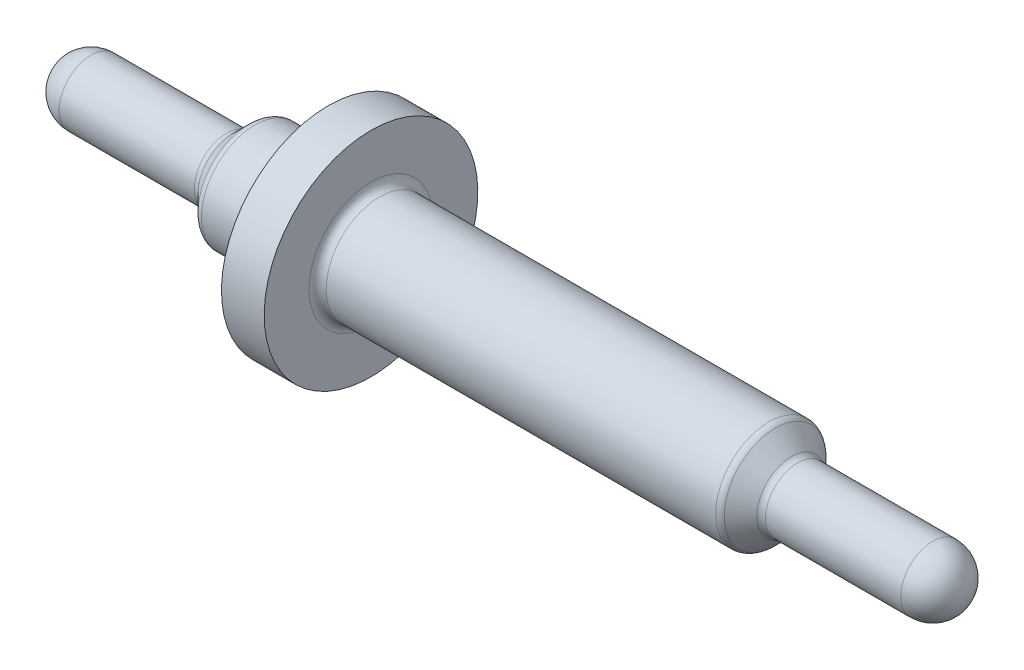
ISO-10303-21;
HEADER;
FILE_DESCRIPTION(('STEP AP214'),'2;1');
FILE_NAME('part.step','',(''),(''),'','','');
FILE_SCHEMA(('AUTOMOTIVE_DESIGN { 1 0 10303 214 1 1 1 1 }'));
ENDSEC;
DATA;
#1=APPLICATION_CONTEXT('core data for automotive mechanical design processes');
#2=APPLICATION_PROTOCOL_DEFINITION('international standard','automotive_design',2000,#1);
#3=PRODUCT_CONTEXT('',#1,'mechanical');
#4=PRODUCT('Part','Part','',(#3));
#5=PRODUCT_RELATED_PRODUCT_CATEGORY('part','',(#4));
#6=PRODUCT_DEFINITION_FORMATION('','',#4);
#7=PRODUCT_DEFINITION_CONTEXT('part definition',#1,'design');
#8=PRODUCT_DEFINITION('design','',#6,#7);
#9=PRODUCT_DEFINITION_SHAPE('','',#8);
#10=(LENGTH_UNIT() NAMED_UNIT(*) SI_UNIT(.MILLI.,.METRE.));
#11=(NAMED_UNIT(*) PLANE_ANGLE_UNIT() SI_UNIT($,.RADIAN.));
#12=(NAMED_UNIT(*) SI_UNIT($,.STERADIAN.) SOLID_ANGLE_UNIT());
#13=UNCERTAINTY_MEASURE_WITH_UNIT(LENGTH_MEASURE(1.E-05),#10,'distance_accuracy_value','');
#14=(GEOMETRIC_REPRESENTATION_CONTEXT(3) GLOBAL_UNCERTAINTY_ASSIGNED_CONTEXT((#13)) GLOBAL_UNIT_ASSIGNED_CONTEXT((#10,
#11,#12)) REPRESENTATION_CONTEXT('',''));
#15=CARTESIAN_POINT('',(0.,0.,0.));
#16=DIRECTION('',(0.,0.,1.));
#17=DIRECTION('',(1.,0.,0.));
#18=AXIS2_PLACEMENT_3D('',#15,#16,#17);
#19=CARTESIAN_POINT('',(21.2,0.,0.));
#20=DIRECTION('',(1.,0.,0.));
#21=DIRECTION('',(0.,1.,0.));
#22=AXIS2_PLACEMENT_3D('',#19,#20,#21);
#23=CYLINDRICAL_SURFACE('',#22,0.749999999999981);
#24=CARTESIAN_POINT('',(3.91715728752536,0.,0.));
#25=DIRECTION('',(1.,0.,0.));
#26=DIRECTION('',(0.,1.,0.));
#27=AXIS2_PLACEMENT_3D('',#24,#25,#26);
#28=CIRCLE('',#27,0.749999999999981);
#29=CARTESIAN_POINT('',(3.91715728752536,0.749999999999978,0.));
#30=VERTEX_POINT('',#29);
#31=EDGE_CURVE('E29',#30,#30,#28,.F.);
#32=ORIENTED_EDGE('',*,*,#31,.T.);
#33=EDGE_LOOP('',(#32));
#34=FACE_BOUND('',#33,.T.);
#35=CARTESIAN_POINT('',(0.75,0.,0.));
#36=DIRECTION('',(1.,0.,0.));
#37=DIRECTION('',(0.,1.,0.));
#38=AXIS2_PLACEMENT_3D('',#35,#36,#37);
#39=CIRCLE('',#38,0.749999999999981);
#40=CARTESIAN_POINT('',(0.750000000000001,0.74999999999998,0.));
#41=VERTEX_POINT('',#40);
#42=EDGE_CURVE('E58',#41,#41,#39,.T.);
#43=ORIENTED_EDGE('',*,*,#42,.T.);
#44=EDGE_LOOP('',(#43));
#45=FACE_BOUND('',#44,.T.);
#46=ADVANCED_FACE('F14',(#34,#45),#23,.T.);
#47=CARTESIAN_POINT('',(21.2,0.,0.));
#48=DIRECTION('',(1.,0.,0.));
#49=DIRECTION('',(0.,1.,0.));
#50=AXIS2_PLACEMENT_3D('',#47,#48,#49);
#51=CYLINDRICAL_SURFACE('',#50,1.25);
#52=CARTESIAN_POINT('',(6.1,0.,0.));
#53=DIRECTION('',(-1.,0.,0.));
#54=DIRECTION('',(0.,-1.,0.));
#55=AXIS2_PLACEMENT_3D('',#52,#53,#54);
#56=CIRCLE('',#55,1.25);
#57=CARTESIAN_POINT('',(6.1,-1.25,0.));
#58=VERTEX_POINT('',#57);
#59=EDGE_CURVE('E49',#58,#58,#56,.T.);
#60=ORIENTED_EDGE('',*,*,#59,.T.);
#61=EDGE_LOOP('',(#60));
#62=FACE_BOUND('',#61,.T.);
#63=CARTESIAN_POINT('',(4.58284271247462,0.,0.));
#64=DIRECTION('',(-1.,0.,0.));
#65=DIRECTION('',(0.,-1.,0.));
#66=AXIS2_PLACEMENT_3D('',#63,#64,#65);
#67=CIRCLE('',#66,1.25);
#68=CARTESIAN_POINT('',(4.58284271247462,-1.25,0.));
#69=VERTEX_POINT('',#68);
#70=EDGE_CURVE('E52',#69,#69,#67,.F.);
#71=ORIENTED_EDGE('',*,*,#70,.T.);
#72=EDGE_LOOP('',(#71));
#73=FACE_BOUND('',#72,.T.);
#74=ADVANCED_FACE('F87',(#62,#73),#51,.T.);
#75=CARTESIAN_POINT('',(6.3,1.25,0.));
#76=DIRECTION('',(-1.,0.,0.));
#77=DIRECTION('',(0.,-1.,0.));
#78=AXIS2_PLACEMENT_3D('',#75,#76,#77);
#79=PLANE('',#78);
#80=CARTESIAN_POINT('',(6.3,0.,0.));
#81=DIRECTION('',(-1.,0.,0.));
#82=DIRECTION('',(0.,-1.,0.));
#83=AXIS2_PLACEMENT_3D('',#80,#81,#82);
#84=CIRCLE('',#83,1.45);
#85=CARTESIAN_POINT('',(6.3,-1.45,0.));
#86=VERTEX_POINT('',#85);
#87=EDGE_CURVE('E55',#86,#86,#84,.F.);
#88=ORIENTED_EDGE('',*,*,#87,.T.);
#89=EDGE_LOOP('',(#88));
#90=FACE_BOUND('',#89,.T.);
#91=CARTESIAN_POINT('',(6.3,0.,0.));
#92=DIRECTION('',(1.,0.,0.));
#93=DIRECTION('',(0.,1.,0.));
#94=AXIS2_PLACEMENT_3D('',#91,#92,#93);
#95=CIRCLE('',#94,2.5);
#96=CARTESIAN_POINT('',(6.3,2.5,0.));
#97=VERTEX_POINT('',#96);
#98=EDGE_CURVE('E64',#97,#97,#95,.T.);
#99=ORIENTED_EDGE('',*,*,#98,.F.);
#100=EDGE_LOOP('',(#99));
#101=FACE_BOUND('',#100,.T.);
#102=ADVANCED_FACE('F75',(#90,#101),#79,.T.);
#103=CARTESIAN_POINT('',(21.2,0.,0.));
#104=DIRECTION('',(1.,0.,0.));
#105=DIRECTION('',(0.,1.,0.));
#106=AXIS2_PLACEMENT_3D('',#103,#104,#105);
#107=CYLINDRICAL_SURFACE('',#106,2.5);
#108=ORIENTED_EDGE('',*,*,#98,.T.);
#109=EDGE_LOOP('',(#108));
#110=FACE_BOUND('',#109,.T.);
#111=CARTESIAN_POINT('',(7.3,0.,0.));
#112=DIRECTION('',(1.,0.,0.));
#113=DIRECTION('',(0.,1.,0.));
#114=AXIS2_PLACEMENT_3D('',#111,#112,#113);
#115=CIRCLE('',#114,2.5);
#116=CARTESIAN_POINT('',(7.3,2.49999999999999,0.));
#117=VERTEX_POINT('',#116);
#118=EDGE_CURVE('E67',#117,#117,#115,.T.);
#119=ORIENTED_EDGE('',*,*,#118,.F.);
#120=EDGE_LOOP('',(#119));
#121=FACE_BOUND('',#120,.T.);
#122=ADVANCED_FACE('F73',(#110,#121),#107,.T.);
#123=CARTESIAN_POINT('',(7.3,2.5,0.));
#124=DIRECTION('',(1.,0.,0.));
#125=DIRECTION('',(0.,1.,0.));
#126=AXIS2_PLACEMENT_3D('',#123,#124,#125);
#127=PLANE('',#126);
#128=CARTESIAN_POINT('',(7.3,0.,0.));
#129=DIRECTION('',(1.,0.,0.));
#130=DIRECTION('',(0.,1.,0.));
#131=AXIS2_PLACEMENT_3D('',#128,#129,#130);
#132=CIRCLE('',#131,1.45);
#133=CARTESIAN_POINT('',(7.3,1.44999999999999,0.));
#134=VERTEX_POINT('',#133);
#135=EDGE_CURVE('E40',#134,#134,#132,.F.);
#136=ORIENTED_EDGE('',*,*,#135,.T.);
#137=EDGE_LOOP('',(#136));
#138=FACE_BOUND('',#137,.T.);
#139=ORIENTED_EDGE('',*,*,#118,.T.);
#140=EDGE_LOOP('',(#139));
#141=FACE_BOUND('',#140,.T.);
#142=ADVANCED_FACE('F71',(#138,#141),#127,.T.);
#143=CARTESIAN_POINT('',(21.2,0.,0.));
#144=DIRECTION('',(1.,0.,0.));
#145=DIRECTION('',(0.,1.,0.));
#146=AXIS2_PLACEMENT_3D('',#143,#144,#145);
#147=CYLINDRICAL_SURFACE('',#146,1.25);
#148=CARTESIAN_POINT('',(7.5,0.,0.));
#149=DIRECTION('',(1.,0.,0.));
#150=DIRECTION('',(0.,1.,0.));
#151=AXIS2_PLACEMENT_3D('',#148,#149,#150);
#152=CIRCLE('',#151,1.25);
#153=CARTESIAN_POINT('',(7.5,1.24999999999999,0.));
#154=VERTEX_POINT('',#153);
#155=EDGE_CURVE('E43',#154,#154,#152,.T.);
#156=ORIENTED_EDGE('',*,*,#155,.T.);
#157=EDGE_LOOP('',(#156));
#158=FACE_BOUND('',#157,.T.);
#159=CARTESIAN_POINT('',(16.6171572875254,0.,0.));
#160=DIRECTION('',(1.,0.,0.));
#161=DIRECTION('',(0.,1.,0.));
#162=AXIS2_PLACEMENT_3D('',#159,#160,#161);
#163=CIRCLE('',#162,1.25);
#164=CARTESIAN_POINT('',(16.6171572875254,1.24999999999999,0.));
#165=VERTEX_POINT('',#164);
#166=EDGE_CURVE('E46',#165,#165,#163,.F.);
#167=ORIENTED_EDGE('',*,*,#166,.T.);
#168=EDGE_LOOP('',(#167));
#169=FACE_BOUND('',#168,.T.);
#170=ADVANCED_FACE('F84',(#158,#169),#147,.T.);
#171=CARTESIAN_POINT('',(21.2,0.,0.));
#172=DIRECTION('',(1.,0.,0.));
#173=DIRECTION('',(0.,1.,0.));
#174=AXIS2_PLACEMENT_3D('',#171,#172,#173);
#175=CYLINDRICAL_SURFACE('',#174,0.750000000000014);
#176=CARTESIAN_POINT('',(17.2828427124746,0.,0.));
#177=DIRECTION('',(1.,0.,0.));
#178=DIRECTION('',(0.,1.,0.));
#179=AXIS2_PLACEMENT_3D('',#176,#177,#178);
#180=CIRCLE('',#179,0.750000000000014);
#181=CARTESIAN_POINT('',(17.2828427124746,0.750000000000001,0.));
#182=VERTEX_POINT('',#181);
#183=EDGE_CURVE('E25',#182,#182,#180,.T.);
#184=ORIENTED_EDGE('',*,*,#183,.T.);
#185=EDGE_LOOP('',(#184));
#186=FACE_BOUND('',#185,.T.);
#187=CARTESIAN_POINT('',(20.45,0.,0.));
#188=DIRECTION('',(1.,0.,0.));
#189=DIRECTION('',(0.,1.,0.));
#190=AXIS2_PLACEMENT_3D('',#187,#188,#189);
#191=CIRCLE('',#190,0.750000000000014);
#192=CARTESIAN_POINT('',(20.45,0.749999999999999,0.));
#193=VERTEX_POINT('',#192);
#194=EDGE_CURVE('E61',#193,#193,#191,.F.);
#195=ORIENTED_EDGE('',*,*,#194,.T.);
#196=EDGE_LOOP('',(#195));
#197=FACE_BOUND('',#196,.T.);
#198=ADVANCED_FACE('F105',(#186,#197),#175,.T.);
#199=CARTESIAN_POINT('',(20.45,0.,0.));
#200=DIRECTION('',(0.,0.,1.));
#201=DIRECTION('',(1.,0.,0.));
#202=AXIS2_PLACEMENT_3D('',#199,#200,#201);
#203=SPHERICAL_SURFACE('',#202,0.75);
#204=CARTESIAN_POINT('',(20.45,0.,0.));
#205=DIRECTION('',(1.,0.,0.));
#206=DIRECTION('',(0.,1.,0.));
#207=AXIS2_PLACEMENT_3D('',#204,#205,#206);
#208=SPHERICAL_SURFACE('',#207,0.75);
#209=ORIENTED_EDGE('',*,*,#194,.F.);
#210=EDGE_LOOP('',(#209));
#211=FACE_BOUND('',#210,.T.);
#212=ADVANCED_FACE('F101',(#211),#208,.T.);
#213=CARTESIAN_POINT('',(0.75,0.,0.));
#214=DIRECTION('',(0.,0.,1.));
#215=DIRECTION('',(1.,0.,0.));
#216=AXIS2_PLACEMENT_3D('',#213,#214,#215);
#217=SPHERICAL_SURFACE('',#216,0.75);
#218=CARTESIAN_POINT('',(0.75,0.,0.));
#219=DIRECTION('',(1.,0.,0.));
#220=DIRECTION('',(0.,1.,0.));
#221=AXIS2_PLACEMENT_3D('',#218,#219,#220);
#222=SPHERICAL_SURFACE('',#221,0.75);
#223=ORIENTED_EDGE('',*,*,#42,.F.);
#224=EDGE_LOOP('',(#223));
#225=FACE_BOUND('',#224,.T.);
#226=ADVANCED_FACE('F104',(#225),#222,.T.);
#227=CARTESIAN_POINT('',(4.5,0.,0.));
#228=DIRECTION('',(1.,0.,0.));
#229=DIRECTION('',(0.,1.,0.));
#230=AXIS2_PLACEMENT_3D('',#227,#228,#229);
#231=CONICAL_SURFACE('',#230,1.25,0.785398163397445);
#232=CARTESIAN_POINT('',(4.44142135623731,0.,0.));
#233=DIRECTION('',(-1.,0.,0.));
#234=DIRECTION('',(0.,-1.,0.));
#235=AXIS2_PLACEMENT_3D('',#232,#233,#234);
#236=CIRCLE('',#235,1.19142135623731);
#237=CARTESIAN_POINT('',(4.44142135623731,-1.19142135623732,0.));
#238=VERTEX_POINT('',#237);
#239=EDGE_CURVE('E34',#238,#238,#236,.T.);
#240=ORIENTED_EDGE('',*,*,#239,.T.);
#241=EDGE_LOOP('',(#240));
#242=FACE_BOUND('',#241,.T.);
#243=CARTESIAN_POINT('',(4.05857864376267,0.,0.));
#244=DIRECTION('',(1.,0.,0.));
#245=DIRECTION('',(0.,1.,0.));
#246=AXIS2_PLACEMENT_3D('',#243,#244,#245);
#247=CIRCLE('',#246,0.808578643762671);
#248=CARTESIAN_POINT('',(4.05857864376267,0.808578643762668,0.));
#249=VERTEX_POINT('',#248);
#250=EDGE_CURVE('E37',#249,#249,#247,.T.);
#251=ORIENTED_EDGE('',*,*,#250,.T.);
#252=EDGE_LOOP('',(#251));
#253=FACE_BOUND('',#252,.T.);
#254=ADVANCED_FACE('F109',(#242,#253),#231,.T.);
#255=CARTESIAN_POINT('',(17.2,0.,0.));
#256=DIRECTION('',(-1.,0.,0.));
#257=DIRECTION('',(0.,-1.,0.));
#258=AXIS2_PLACEMENT_3D('',#255,#256,#257);
#259=CONICAL_SURFACE('',#258,0.75,0.78539816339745);
#260=CARTESIAN_POINT('',(17.1414213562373,0.,0.));
#261=DIRECTION('',(-1.,0.,0.));
#262=DIRECTION('',(0.,-1.,0.));
#263=AXIS2_PLACEMENT_3D('',#260,#261,#262);
#264=CIRCLE('',#263,0.808578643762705);
#265=CARTESIAN_POINT('',(17.1414213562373,-0.808578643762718,0.));
#266=VERTEX_POINT('',#265);
#267=EDGE_CURVE('E10',#266,#266,#264,.T.);
#268=ORIENTED_EDGE('',*,*,#267,.T.);
#269=EDGE_LOOP('',(#268));
#270=FACE_BOUND('',#269,.T.);
#271=CARTESIAN_POINT('',(16.7585786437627,0.,0.));
#272=DIRECTION('',(1.,0.,0.));
#273=DIRECTION('',(0.,1.,0.));
#274=AXIS2_PLACEMENT_3D('',#271,#272,#273);
#275=CIRCLE('',#274,1.1914213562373);
#276=CARTESIAN_POINT('',(16.7585786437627,1.19142135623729,0.));
#277=VERTEX_POINT('',#276);
#278=EDGE_CURVE('E21',#277,#277,#275,.T.);
#279=ORIENTED_EDGE('',*,*,#278,.T.);
#280=EDGE_LOOP('',(#279));
#281=FACE_BOUND('',#280,.T.);
#282=ADVANCED_FACE('F113',(#270,#281),#259,.T.);
#283=CARTESIAN_POINT('',(6.1,0.,0.));
#284=DIRECTION('',(-1.,0.,0.));
#285=DIRECTION('',(0.,-1.,0.));
#286=AXIS2_PLACEMENT_3D('',#283,#284,#285);
#287=TOROIDAL_SURFACE('',#286,1.45,0.2);
#288=ORIENTED_EDGE('',*,*,#59,.F.);
#289=EDGE_LOOP('',(#288));
#290=FACE_BOUND('',#289,.T.);
#291=ORIENTED_EDGE('',*,*,#87,.F.);
#292=EDGE_LOOP('',(#291));
#293=FACE_BOUND('',#292,.T.);
#294=ADVANCED_FACE('F117',(#290,#293),#287,.F.);
#295=CARTESIAN_POINT('',(7.5,0.,0.));
#296=DIRECTION('',(1.,0.,0.));
#297=DIRECTION('',(0.,1.,0.));
#298=AXIS2_PLACEMENT_3D('',#295,#296,#297);
#299=TOROIDAL_SURFACE('',#298,1.45,0.2);
#300=ORIENTED_EDGE('',*,*,#135,.F.);
#301=EDGE_LOOP('',(#300));
#302=FACE_BOUND('',#301,.T.);
#303=ORIENTED_EDGE('',*,*,#155,.F.);
#304=EDGE_LOOP('',(#303));
#305=FACE_BOUND('',#304,.T.);
#306=ADVANCED_FACE('F120',(#302,#305),#299,.F.);
#307=CARTESIAN_POINT('',(4.58284271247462,0.,0.));
#308=DIRECTION('',(-1.,0.,0.));
#309=DIRECTION('',(0.,-1.,0.));
#310=AXIS2_PLACEMENT_3D('',#307,#308,#309);
#311=TOROIDAL_SURFACE('',#310,1.05,0.2);
#312=ORIENTED_EDGE('',*,*,#239,.F.);
#313=EDGE_LOOP('',(#312));
#314=FACE_BOUND('',#313,.T.);
#315=ORIENTED_EDGE('',*,*,#70,.F.);
#316=EDGE_LOOP('',(#315));
#317=FACE_BOUND('',#316,.T.);
#318=ADVANCED_FACE('F124',(#314,#317),#311,.T.);
#319=CARTESIAN_POINT('',(3.91715728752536,0.,0.));
#320=DIRECTION('',(1.,0.,0.));
#321=DIRECTION('',(0.,1.,0.));
#322=AXIS2_PLACEMENT_3D('',#319,#320,#321);
#323=TOROIDAL_SURFACE('',#322,0.949999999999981,0.2);
#324=ORIENTED_EDGE('',*,*,#31,.F.);
#325=EDGE_LOOP('',(#324));
#326=FACE_BOUND('',#325,.T.);
#327=ORIENTED_EDGE('',*,*,#250,.F.);
#328=EDGE_LOOP('',(#327));
#329=FACE_BOUND('',#328,.T.);
#330=ADVANCED_FACE('F128',(#326,#329),#323,.F.);
#331=CARTESIAN_POINT('',(17.2828427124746,0.,0.));
#332=DIRECTION('',(1.,0.,0.));
#333=DIRECTION('',(0.,1.,0.));
#334=AXIS2_PLACEMENT_3D('',#331,#332,#333);
#335=TOROIDAL_SURFACE('',#334,0.950000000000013,0.2);
#336=ORIENTED_EDGE('',*,*,#267,.F.);
#337=EDGE_LOOP('',(#336));
#338=FACE_BOUND('',#337,.T.);
#339=ORIENTED_EDGE('',*,*,#183,.F.);
#340=EDGE_LOOP('',(#339));
#341=FACE_BOUND('',#340,.T.);
#342=ADVANCED_FACE('F131',(#338,#341),#335,.F.);
#343=CARTESIAN_POINT('',(16.6171572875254,0.,0.));
#344=DIRECTION('',(1.,0.,0.));
#345=DIRECTION('',(0.,1.,0.));
#346=AXIS2_PLACEMENT_3D('',#343,#344,#345);
#347=TOROIDAL_SURFACE('',#346,1.05,0.2);
#348=ORIENTED_EDGE('',*,*,#278,.F.);
#349=EDGE_LOOP('',(#348));
#350=FACE_BOUND('',#349,.T.);
#351=ORIENTED_EDGE('',*,*,#166,.F.);
#352=EDGE_LOOP('',(#351));
#353=FACE_BOUND('',#352,.T.);
#354=ADVANCED_FACE('F16',(#350,#353),#347,.T.);
#355=CLOSED_SHELL('',(#46,#74,#102,#122,#142,#170,#198,#212,#226,#254,#282,#294,#306,#318,#330,
#342,#354));
#356=MANIFOLD_SOLID_BREP('B1',#355);
#357=ADVANCED_BREP_SHAPE_REPRESENTATION('',(#18,#356),#14);
#358=SHAPE_DEFINITION_REPRESENTATION(#9,#357);
ENDSEC;
END-ISO-10303-21;
